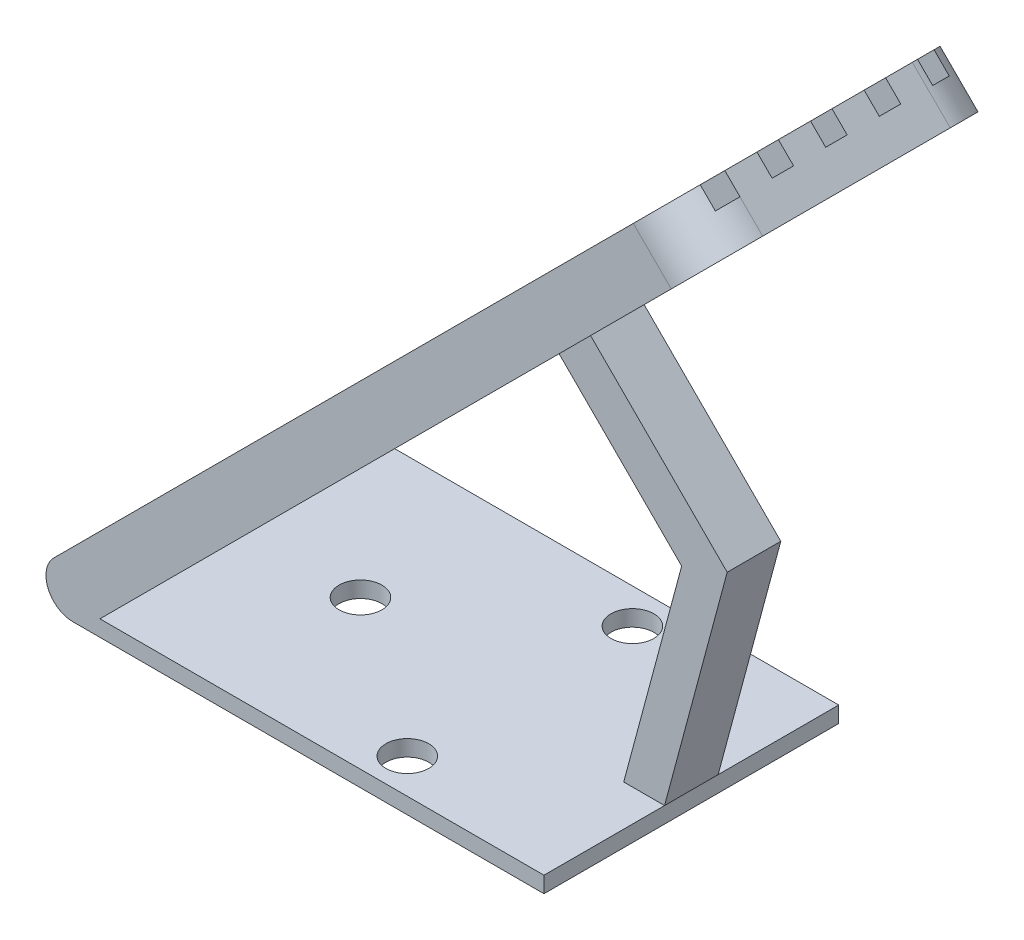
from build123d import *

# Parameters (mm, degrees)
BOSS_EXTRUDE1_DEPTH = 27.5
BOSS_EXTRUDE2_DEPTH = 5
SKETCH2_W           = 4
SKETCH2_H           = 4
CUT_EXTRUDE1_DEPTH  = 185.320761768
LPATTERN1_COUNT     = 7
LPATTERN1_PITCH     = 10
FILLET1_R           = 10
SKETCH3_R           = 4
CUT_EXTRUDE2_DEPTH  = 3


with BuildPart() as part:
    # Sketch1 → Boss-Extrude1 (new, symmetric)
    with BuildSketch(Plane.XY):
        with BuildLine():
            Line((-87.928932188, 0), (0, 0))
            Line((0, 0), (0, 3))
            Line((0, 3), (-7.622161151, 3))
            Line((-7.622161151, 3), (-82.857864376, 3))
            Line((-82.857864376, 3), (-19.684436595, 66.173427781))
            Line((-19.684436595, 66.173427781), (-13.809002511, 72.048861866))
            Line((-13.809002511, 72.048861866), (20, 105.857864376))
            Line((20, 105.857864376), (30.81475452, 116.672618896))
            Line((30.81475452, 116.672618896), (23.743686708, 123.743686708))
            Line((23.743686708, 123.743686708), (-91.464466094, 8.535533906))
            ThreePointArc((-91.464466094, 8.535533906), (-92.548329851, 3.086582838), (-87.928932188, 0))
        make_face()
    extrude(amount=BOSS_EXTRUDE1_DEPTH, both=True)

    # Sketch1_3 → Boss-Extrude2 (add, symmetric)
    with BuildSketch(Plane.XY):
        Polygon((-7.622161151, 3), (0, 3), (11.688359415, 46.55149994), (-13.809002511, 72.048861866), (-19.684436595, 66.173427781), (3.192593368, 43.296397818), align=None)
    extrude(amount=BOSS_EXTRUDE2_DEPTH, both=True)

    # Sketch2 → Cut-Extrude1 (cut, through all)
    with BuildSketch(Plane(origin=(73.743686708, 73.743686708, 0), x_dir=(0, 0, -1), z_dir=(0.7071067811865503, 0.7071067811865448, 0))):
        with Locations((-19.5, 68.710678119)):
            Rectangle(SKETCH2_W, SKETCH2_H)
    cut_extrude1 = extrude(amount=-CUT_EXTRUDE1_DEPTH, mode=Mode.SUBTRACT)

    # LPattern1: Cut-Extrude1 ×7
    with Locations(*[(0, 0, -i * LPATTERN1_PITCH) for i in range(1, LPATTERN1_COUNT)]):
        add(cut_extrude1, mode=Mode.SUBTRACT)

    # Fillet1
    fillet1_edges = [part.edges().sort_by_distance(p)[0] for p in [
        (27.279220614, 120.208152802, -27.5),
        (27.279220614, 120.208152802, 27.5),
    ]]
    fillet(fillet1_edges, radius=FILLET1_R)

    # Sketch3 → Cut-Extrude2 (cut)
    with BuildSketch(Plane.XZ):
        with Locations((-32, 21)):
            Circle(SKETCH3_R)
        with Locations((-32, -21)):
            Circle(SKETCH3_R)
        with Locations((-62, -0.259792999)):
            Circle(SKETCH3_R)
    extrude(amount=-CUT_EXTRUDE2_DEPTH, mode=Mode.SUBTRACT)


solid = part.part
